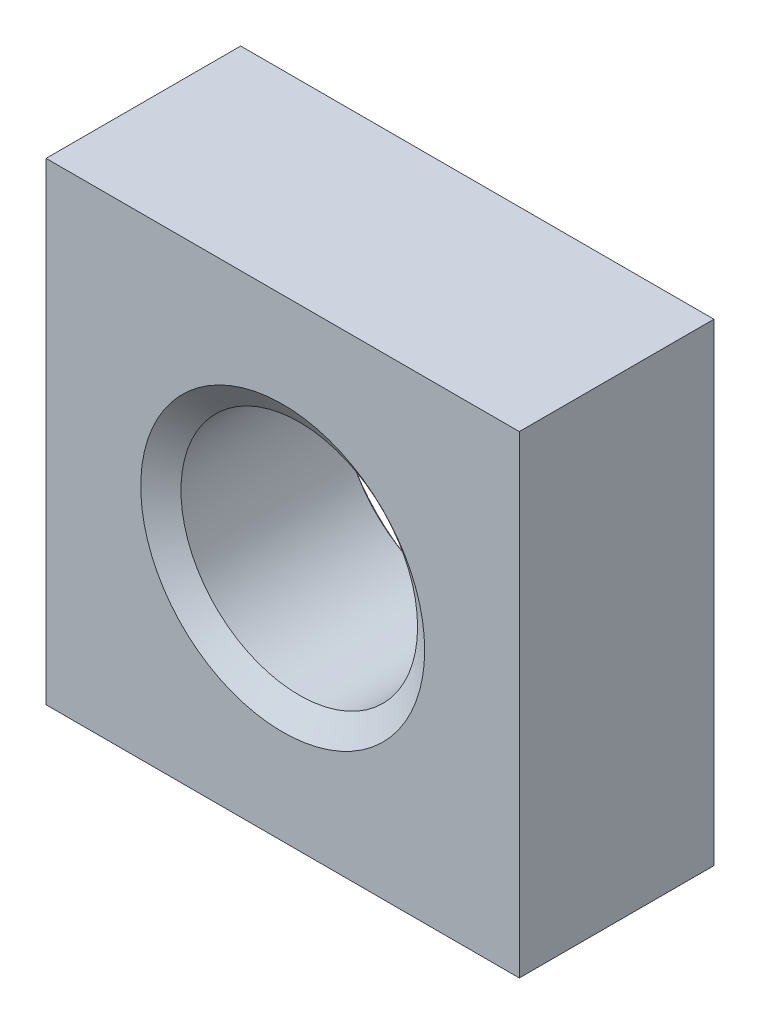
from build123d import *

# Parameters (mm, degrees)
BASENUT_START = -6.5278
BASENUTSKE_W  = 15.875
BASENUTSKE_H  = 15.875
BASENUTSKE_R  = 3.96875
BASENUT_DEPTH = 6.5278


with BuildPart() as part:
    # BaseNutSke → BaseNut (new body)
    with BuildSketch(Plane.XY.offset(BASENUT_START)):
        Rectangle(BASENUTSKE_W, BASENUTSKE_H)
        Circle(BASENUTSKE_R, mode=Mode.SUBTRACT)
    extrude(amount=BASENUT_DEPTH)

    # EndChamferSketch → EndChamfer (revolve, cut)
    with BuildSketch(Plane(origin=(0, 0, 0), x_dir=(0, 0, -1), z_dir=(1, 0, 0)), mode=Mode.PRIVATE) as endchamfer_sk:
        Polygon((6.5024, 4.7625), (5.891031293, 3.889375), (6.5532, 3.889375), (6.5532, 4.7625), align=None)
        Polygon((-0.0508, 4.7625), (0, 4.7625), (0.611368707, 3.889375), (-0.0508, 3.889375), align=None)
    revolve(endchamfer_sk.sketch.rotate(Axis((0, 0, -25.037505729), (0, 0, -1)), 90), axis=Axis((0, 0, -25.037505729), (0, 0, -1)), mode=Mode.SUBTRACT)


solid = part.part
